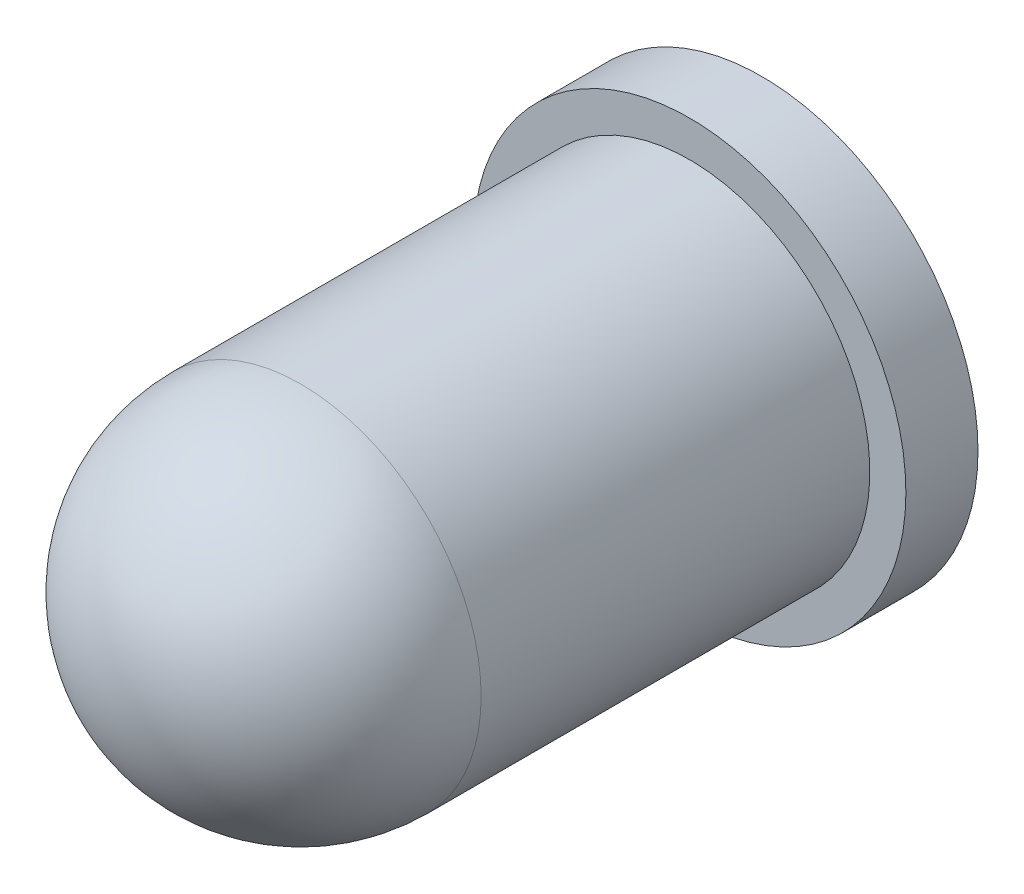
from build123d import *


with BuildPart() as part:
    # Sketch2 → Revolve1 (revolve)
    with BuildSketch(Plane(origin=(0, 0, 0), x_dir=(0, 0, -1), z_dir=(1, 0, 0)), mode=Mode.PRIVATE) as revolve1_sk:
        with BuildLine():
            Line((0, 0), (0, 3))
            Line((0, 3), (-1, 3))
            Line((-1, 3), (-1, 2.5))
            Line((-1, 2.5), (-6.39, 2.5))
            ThreePointArc((-6.39, 2.5), (-8.157766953, 1.767766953), (-8.89, 0))
            Line((-8.89, 0), (0, 0))
        make_face()
    revolve(revolve1_sk.sketch.rotate(Axis((0, 0, 0), (0, 0, 1)), 90), axis=Axis((0, 0, 0), (0, 0, 1)))


solid = part.part
